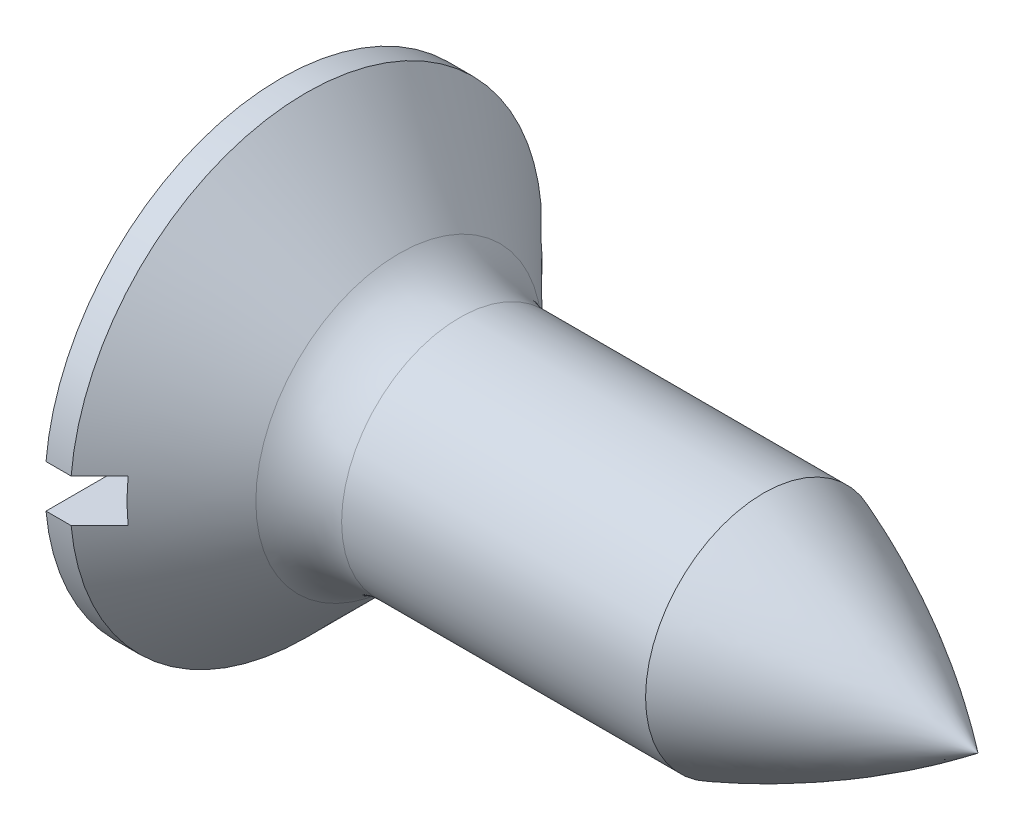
from build123d import *

# Parameters (mm, degrees)
SLOT_DEPTH      = 8.20624729
SLOT_DEPTH_BACK = 8.20624729
SKETCH2_W       = 0.5
SKETCH2_H       = 0.4


with BuildPart() as part:
    # Sketch1 → Base (revolve)
    with BuildSketch(Plane.XY, mode=Mode.PRIVATE) as base_sk:
        with BuildLine():
            Line((6.5, 0), (6.5, 1.1))
            Line((6.5, 1.1), (1.665685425, 1.1))
            ThreePointArc((1.665685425, 1.1), (1.359538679, 1.160896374), (1.1, 1.334314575))
            Line((1.1, 1.334314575), (0.234314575, 2.2))
            Line((0.234314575, 2.2), (0, 2.2))
            Line((0, 2.2), (0, 0))
            Line((0, 0), (6.5, 0))
        make_face()
    revolve(base_sk.sketch.rotate(Axis((-9.694470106, 0, 0), (1, 0, 0)), 90), axis=Axis((-9.694470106, 0, 0), (1, 0, 0)))

    # Sketch2 → Slot (cut, two sides: drawn at the far end of the back side and taken through both)
    with BuildSketch(Plane.XY.offset(-SLOT_DEPTH_BACK)):
        with Locations((0.25, 0)):
            Rectangle(SKETCH2_W, SKETCH2_H)
    extrude(amount=SLOT_DEPTH + SLOT_DEPTH_BACK, mode=Mode.SUBTRACT)

    # Sketch4 → Cut-Revolve6 (revolve, cut)
    with BuildSketch(Plane.XY, mode=Mode.PRIVATE) as cut_revolve6_sk:
        with BuildLine():
            Line((6.5, 0), (7, 0))
            Line((7, 0), (7, -1.1))
            Line((7, -1.1), (6.5, -1.1))
            Line((6.5, -1.1), (4.5, -1.1))
            ThreePointArc((4.5, -1.1), (5.53943286, -0.621696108), (6.5, 0))
        make_face()
    revolve(cut_revolve6_sk.sketch.rotate(Axis((33.240663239, 0, 0), (-1, 0, 0)), 90), axis=Axis((33.240663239, 0, 0), (-1, 0, 0)), mode=Mode.SUBTRACT)


solid = part.part
